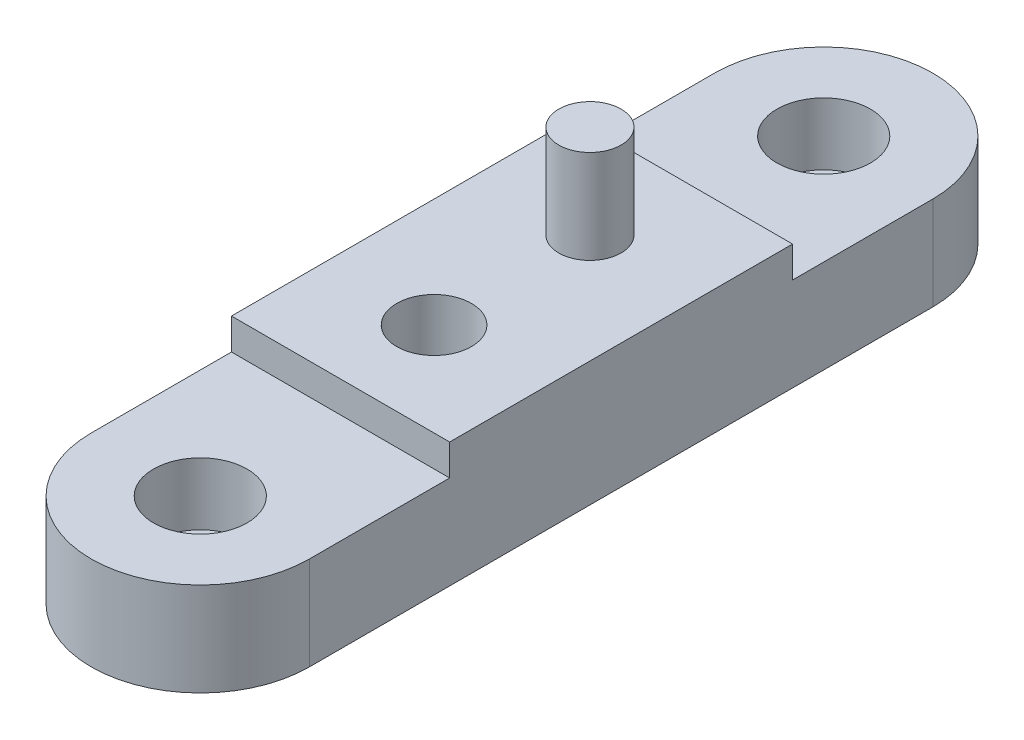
ISO-10303-21;
HEADER;
FILE_DESCRIPTION(('STEP AP214'),'2;1');
FILE_NAME('part.step','',(''),(''),'','','');
FILE_SCHEMA(('AUTOMOTIVE_DESIGN { 1 0 10303 214 1 1 1 1 }'));
ENDSEC;
DATA;
#1=APPLICATION_CONTEXT('core data for automotive mechanical design processes');
#2=APPLICATION_PROTOCOL_DEFINITION('international standard','automotive_design',2000,#1);
#3=PRODUCT_CONTEXT('',#1,'mechanical');
#4=PRODUCT('Part','Part','',(#3));
#5=PRODUCT_RELATED_PRODUCT_CATEGORY('part','',(#4));
#6=PRODUCT_DEFINITION_FORMATION('','',#4);
#7=PRODUCT_DEFINITION_CONTEXT('part definition',#1,'design');
#8=PRODUCT_DEFINITION('design','',#6,#7);
#9=PRODUCT_DEFINITION_SHAPE('','',#8);
#10=(LENGTH_UNIT() NAMED_UNIT(*) SI_UNIT(.MILLI.,.METRE.));
#11=(NAMED_UNIT(*) PLANE_ANGLE_UNIT() SI_UNIT($,.RADIAN.));
#12=(NAMED_UNIT(*) SI_UNIT($,.STERADIAN.) SOLID_ANGLE_UNIT());
#13=UNCERTAINTY_MEASURE_WITH_UNIT(LENGTH_MEASURE(1.E-05),#10,'distance_accuracy_value','');
#14=(GEOMETRIC_REPRESENTATION_CONTEXT(3) GLOBAL_UNCERTAINTY_ASSIGNED_CONTEXT((#13)) GLOBAL_UNIT_ASSIGNED_CONTEXT((#10,
#11,#12)) REPRESENTATION_CONTEXT('',''));
#15=CARTESIAN_POINT('',(0.,0.,0.));
#16=DIRECTION('',(0.,0.,1.));
#17=DIRECTION('',(1.,0.,0.));
#18=AXIS2_PLACEMENT_3D('',#15,#16,#17);
#19=CARTESIAN_POINT('',(0.,4.,0.));
#20=DIRECTION('',(0.,-1.,0.));
#21=DIRECTION('',(0.,0.,-1.));
#22=AXIS2_PLACEMENT_3D('',#19,#20,#21);
#23=CYLINDRICAL_SURFACE('',#22,3.5);
#24=CARTESIAN_POINT('',(0.,3.,0.));
#25=DIRECTION('',(0.,1.,0.));
#26=DIRECTION('',(0.,0.,1.));
#27=AXIS2_PLACEMENT_3D('',#24,#25,#26);
#28=CIRCLE('',#27,3.5);
#29=CARTESIAN_POINT('',(3.5,3.,0.));
#30=VERTEX_POINT('',#29);
#31=CARTESIAN_POINT('',(-3.5,3.,0.));
#32=VERTEX_POINT('',#31);
#33=EDGE_CURVE('E159',#30,#32,#28,.T.);
#34=ORIENTED_EDGE('',*,*,#33,.F.);
#35=DIRECTION('',(0.,-1.,0.));
#36=VECTOR('',#35,1.);
#37=CARTESIAN_POINT('',(3.5,4.,0.));
#38=LINE('',#37,#36);
#39=CARTESIAN_POINT('',(3.5,0.,0.));
#40=VERTEX_POINT('',#39);
#41=EDGE_CURVE('E44',#30,#40,#38,.T.);
#42=ORIENTED_EDGE('',*,*,#41,.T.);
#43=CARTESIAN_POINT('',(0.,0.,0.));
#44=DIRECTION('',(0.,1.,0.));
#45=DIRECTION('',(0.,0.,1.));
#46=AXIS2_PLACEMENT_3D('',#43,#44,#45);
#47=CIRCLE('',#46,3.5);
#48=CARTESIAN_POINT('',(-3.5,0.,0.));
#49=VERTEX_POINT('',#48);
#50=EDGE_CURVE('E165',#40,#49,#47,.T.);
#51=ORIENTED_EDGE('',*,*,#50,.T.);
#52=DIRECTION('',(0.,-1.,0.));
#53=VECTOR('',#52,1.);
#54=CARTESIAN_POINT('',(-3.5,4.,0.));
#55=LINE('',#54,#53);
#56=EDGE_CURVE('E11',#32,#49,#55,.T.);
#57=ORIENTED_EDGE('',*,*,#56,.F.);
#58=EDGE_LOOP('',(#34,#42,#51,#57));
#59=FACE_BOUND('',#58,.T.);
#60=ADVANCED_FACE('F37',(#59),#23,.T.);
#61=CARTESIAN_POINT('',(-3.5,4.,0.));
#62=DIRECTION('',(1.,0.,0.));
#63=DIRECTION('',(0.,0.,-1.));
#64=AXIS2_PLACEMENT_3D('',#61,#62,#63);
#65=PLANE('',#64);
#66=DIRECTION('',(0.,0.,1.));
#67=VECTOR('',#66,1.);
#68=CARTESIAN_POINT('',(-3.5,4.,0.));
#69=LINE('',#68,#67);
#70=CARTESIAN_POINT('',(-3.5,4.,4.5));
#71=VERTEX_POINT('',#70);
#72=CARTESIAN_POINT('',(-3.5,4.,15.5));
#73=VERTEX_POINT('',#72);
#74=EDGE_CURVE('E167',#71,#73,#69,.T.);
#75=ORIENTED_EDGE('',*,*,#74,.F.);
#76=DIRECTION('',(0.,1.,0.));
#77=VECTOR('',#76,1.);
#78=CARTESIAN_POINT('',(-3.5,3.,4.5));
#79=LINE('',#78,#77);
#80=CARTESIAN_POINT('',(-3.5,3.,4.5));
#81=VERTEX_POINT('',#80);
#82=EDGE_CURVE('E51',#81,#71,#79,.T.);
#83=ORIENTED_EDGE('',*,*,#82,.F.);
#84=DIRECTION('',(0.,0.,1.));
#85=VECTOR('',#84,1.);
#86=CARTESIAN_POINT('',(-3.5,3.,0.));
#87=LINE('',#86,#85);
#88=EDGE_CURVE('E151',#32,#81,#87,.T.);
#89=ORIENTED_EDGE('',*,*,#88,.F.);
#90=ORIENTED_EDGE('',*,*,#56,.T.);
#91=DIRECTION('',(0.,0.,1.));
#92=VECTOR('',#91,1.);
#93=CARTESIAN_POINT('',(-3.5,0.,0.));
#94=LINE('',#93,#92);
#95=CARTESIAN_POINT('',(-3.5,0.,20.));
#96=VERTEX_POINT('',#95);
#97=EDGE_CURVE('E174',#49,#96,#94,.T.);
#98=ORIENTED_EDGE('',*,*,#97,.T.);
#99=DIRECTION('',(0.,-1.,0.));
#100=VECTOR('',#99,1.);
#101=CARTESIAN_POINT('',(-3.5,4.,20.));
#102=LINE('',#101,#100);
#103=CARTESIAN_POINT('',(-3.5,3.,20.));
#104=VERTEX_POINT('',#103);
#105=EDGE_CURVE('E125',#104,#96,#102,.T.);
#106=ORIENTED_EDGE('',*,*,#105,.F.);
#107=DIRECTION('',(0.,0.,-1.));
#108=VECTOR('',#107,1.);
#109=CARTESIAN_POINT('',(-3.5,3.,20.));
#110=LINE('',#109,#108);
#111=CARTESIAN_POINT('',(-3.5,3.,15.5));
#112=VERTEX_POINT('',#111);
#113=EDGE_CURVE('E105',#104,#112,#110,.T.);
#114=ORIENTED_EDGE('',*,*,#113,.T.);
#115=DIRECTION('',(0.,1.,0.));
#116=VECTOR('',#115,1.);
#117=CARTESIAN_POINT('',(-3.5,3.,15.5));
#118=LINE('',#117,#116);
#119=EDGE_CURVE('E114',#112,#73,#118,.T.);
#120=ORIENTED_EDGE('',*,*,#119,.T.);
#121=EDGE_LOOP('',(#75,#83,#89,#90,#98,#106,#114,#120));
#122=FACE_BOUND('',#121,.T.);
#123=ADVANCED_FACE('F123',(#122),#65,.F.);
#124=CARTESIAN_POINT('',(3.5,4.,0.));
#125=DIRECTION('',(-1.,0.,0.));
#126=DIRECTION('',(0.,0.,1.));
#127=AXIS2_PLACEMENT_3D('',#124,#125,#126);
#128=PLANE('',#127);
#129=DIRECTION('',(0.,0.,-1.));
#130=VECTOR('',#129,1.);
#131=CARTESIAN_POINT('',(3.5,3.,0.));
#132=LINE('',#131,#130);
#133=CARTESIAN_POINT('',(3.5,3.,4.5));
#134=VERTEX_POINT('',#133);
#135=EDGE_CURVE('E157',#134,#30,#132,.T.);
#136=ORIENTED_EDGE('',*,*,#135,.F.);
#137=DIRECTION('',(0.,1.,0.));
#138=VECTOR('',#137,1.);
#139=CARTESIAN_POINT('',(3.5,3.,4.5));
#140=LINE('',#139,#138);
#141=CARTESIAN_POINT('',(3.5,4.,4.5));
#142=VERTEX_POINT('',#141);
#143=EDGE_CURVE('E162',#134,#142,#140,.T.);
#144=ORIENTED_EDGE('',*,*,#143,.T.);
#145=DIRECTION('',(0.,0.,-1.));
#146=VECTOR('',#145,1.);
#147=CARTESIAN_POINT('',(3.5,4.,0.));
#148=LINE('',#147,#146);
#149=CARTESIAN_POINT('',(3.5,4.,15.5));
#150=VERTEX_POINT('',#149);
#151=EDGE_CURVE('E169',#150,#142,#148,.T.);
#152=ORIENTED_EDGE('',*,*,#151,.F.);
#153=DIRECTION('',(0.,1.,0.));
#154=VECTOR('',#153,1.);
#155=CARTESIAN_POINT('',(3.5,3.,15.5));
#156=LINE('',#155,#154);
#157=CARTESIAN_POINT('',(3.5,3.,15.5));
#158=VERTEX_POINT('',#157);
#159=EDGE_CURVE('E120',#158,#150,#156,.T.);
#160=ORIENTED_EDGE('',*,*,#159,.F.);
#161=DIRECTION('',(0.,0.,1.));
#162=VECTOR('',#161,1.);
#163=CARTESIAN_POINT('',(3.5,3.,20.));
#164=LINE('',#163,#162);
#165=CARTESIAN_POINT('',(3.5,3.,20.));
#166=VERTEX_POINT('',#165);
#167=EDGE_CURVE('E107',#158,#166,#164,.T.);
#168=ORIENTED_EDGE('',*,*,#167,.T.);
#169=DIRECTION('',(0.,-1.,0.));
#170=VECTOR('',#169,1.);
#171=CARTESIAN_POINT('',(3.5,4.,20.));
#172=LINE('',#171,#170);
#173=CARTESIAN_POINT('',(3.5,0.,20.));
#174=VERTEX_POINT('',#173);
#175=EDGE_CURVE('E140',#166,#174,#172,.T.);
#176=ORIENTED_EDGE('',*,*,#175,.T.);
#177=DIRECTION('',(0.,0.,-1.));
#178=VECTOR('',#177,1.);
#179=CARTESIAN_POINT('',(3.5,0.,0.));
#180=LINE('',#179,#178);
#181=EDGE_CURVE('E170',#174,#40,#180,.T.);
#182=ORIENTED_EDGE('',*,*,#181,.T.);
#183=ORIENTED_EDGE('',*,*,#41,.F.);
#184=EDGE_LOOP('',(#136,#144,#152,#160,#168,#176,#182,#183));
#185=FACE_BOUND('',#184,.T.);
#186=ADVANCED_FACE('F179',(#185),#128,.F.);
#187=CARTESIAN_POINT('',(0.,4.,0.));
#188=DIRECTION('',(0.,1.,0.));
#189=DIRECTION('',(0.,0.,1.));
#190=AXIS2_PLACEMENT_3D('',#187,#188,#189);
#191=PLANE('',#190);
#192=CARTESIAN_POINT('',(0.,4.,12.5));
#193=DIRECTION('',(0.,1.,0.));
#194=DIRECTION('',(0.,0.,1.));
#195=AXIS2_PLACEMENT_3D('',#192,#193,#194);
#196=CIRCLE('',#195,1.2);
#197=CARTESIAN_POINT('',(0.,4.,13.7));
#198=VERTEX_POINT('',#197);
#199=EDGE_CURVE('E350',#198,#198,#196,.T.);
#200=ORIENTED_EDGE('',*,*,#199,.F.);
#201=EDGE_LOOP('',(#200));
#202=FACE_BOUND('',#201,.T.);
#203=CARTESIAN_POINT('',(0.,4.,7.5));
#204=DIRECTION('',(0.,1.,0.));
#205=DIRECTION('',(0.,0.,1.));
#206=AXIS2_PLACEMENT_3D('',#203,#204,#205);
#207=CIRCLE('',#206,1.);
#208=CARTESIAN_POINT('',(0.,4.,8.5));
#209=VERTEX_POINT('',#208);
#210=EDGE_CURVE('E352',#209,#209,#207,.T.);
#211=ORIENTED_EDGE('',*,*,#210,.F.);
#212=EDGE_LOOP('',(#211));
#213=FACE_BOUND('',#212,.T.);
#214=DIRECTION('',(1.,0.,0.));
#215=VECTOR('',#214,1.);
#216=CARTESIAN_POINT('',(-3.5,4.,4.5));
#217=LINE('',#216,#215);
#218=EDGE_CURVE('E148',#71,#142,#217,.T.);
#219=ORIENTED_EDGE('',*,*,#218,.F.);
#220=ORIENTED_EDGE('',*,*,#74,.T.);
#221=DIRECTION('',(1.,0.,0.));
#222=VECTOR('',#221,1.);
#223=CARTESIAN_POINT('',(-3.5,4.,15.5));
#224=LINE('',#223,#222);
#225=EDGE_CURVE('E117',#73,#150,#224,.T.);
#226=ORIENTED_EDGE('',*,*,#225,.T.);
#227=ORIENTED_EDGE('',*,*,#151,.T.);
#228=EDGE_LOOP('',(#219,#220,#226,#227));
#229=FACE_BOUND('',#228,.T.);
#230=ADVANCED_FACE('F190',(#202,#213,#229),#191,.T.);
#231=CARTESIAN_POINT('',(0.,0.,0.));
#232=DIRECTION('',(0.,1.,0.));
#233=DIRECTION('',(0.,0.,1.));
#234=AXIS2_PLACEMENT_3D('',#231,#232,#233);
#235=PLANE('',#234);
#236=CARTESIAN_POINT('',(0.,0.,12.5));
#237=DIRECTION('',(0.,1.,0.));
#238=DIRECTION('',(0.,0.,1.));
#239=AXIS2_PLACEMENT_3D('',#236,#237,#238);
#240=CIRCLE('',#239,1.2);
#241=CARTESIAN_POINT('',(0.,0.,13.7));
#242=VERTEX_POINT('',#241);
#243=EDGE_CURVE('E347',#242,#242,#240,.T.);
#244=ORIENTED_EDGE('',*,*,#243,.T.);
#245=EDGE_LOOP('',(#244));
#246=FACE_BOUND('',#245,.T.);
#247=ORIENTED_EDGE('',*,*,#50,.F.);
#248=ORIENTED_EDGE('',*,*,#181,.F.);
#249=CARTESIAN_POINT('',(0.,0.,20.));
#250=DIRECTION('',(0.,-1.,0.));
#251=DIRECTION('',(0.,0.,-1.));
#252=AXIS2_PLACEMENT_3D('',#249,#250,#251);
#253=CIRCLE('',#252,3.5);
#254=EDGE_CURVE('E136',#174,#96,#253,.T.);
#255=ORIENTED_EDGE('',*,*,#254,.T.);
#256=ORIENTED_EDGE('',*,*,#97,.F.);
#257=EDGE_LOOP('',(#247,#248,#255,#256));
#258=FACE_BOUND('',#257,.T.);
#259=ADVANCED_FACE('F184',(#246,#258),#235,.F.);
#260=CARTESIAN_POINT('',(-3.5,3.,4.5));
#261=DIRECTION('',(0.,0.,1.));
#262=DIRECTION('',(1.,0.,0.));
#263=AXIS2_PLACEMENT_3D('',#260,#261,#262);
#264=PLANE('',#263);
#265=ORIENTED_EDGE('',*,*,#218,.T.);
#266=ORIENTED_EDGE('',*,*,#143,.F.);
#267=DIRECTION('',(1.,0.,0.));
#268=VECTOR('',#267,1.);
#269=CARTESIAN_POINT('',(-3.5,3.,4.5));
#270=LINE('',#269,#268);
#271=EDGE_CURVE('E154',#81,#134,#270,.T.);
#272=ORIENTED_EDGE('',*,*,#271,.F.);
#273=ORIENTED_EDGE('',*,*,#82,.T.);
#274=EDGE_LOOP('',(#265,#266,#272,#273));
#275=FACE_BOUND('',#274,.T.);
#276=ADVANCED_FACE('F215',(#275),#264,.F.);
#277=CARTESIAN_POINT('',(0.,3.,0.));
#278=DIRECTION('',(0.,1.,0.));
#279=DIRECTION('',(0.,0.,1.));
#280=AXIS2_PLACEMENT_3D('',#277,#278,#279);
#281=PLANE('',#280);
#282=CARTESIAN_POINT('',(0.,3.,0.));
#283=DIRECTION('',(0.,1.,0.));
#284=DIRECTION('',(0.,0.,1.));
#285=AXIS2_PLACEMENT_3D('',#282,#283,#284);
#286=CIRCLE('',#285,1.5);
#287=CARTESIAN_POINT('',(0.,3.,1.5));
#288=VERTEX_POINT('',#287);
#289=EDGE_CURVE('E144',#288,#288,#286,.T.);
#290=ORIENTED_EDGE('',*,*,#289,.F.);
#291=EDGE_LOOP('',(#290));
#292=FACE_BOUND('',#291,.T.);
#293=ORIENTED_EDGE('',*,*,#88,.T.);
#294=ORIENTED_EDGE('',*,*,#271,.T.);
#295=ORIENTED_EDGE('',*,*,#135,.T.);
#296=ORIENTED_EDGE('',*,*,#33,.T.);
#297=EDGE_LOOP('',(#293,#294,#295,#296));
#298=FACE_BOUND('',#297,.T.);
#299=ADVANCED_FACE('F188',(#292,#298),#281,.T.);
#300=CARTESIAN_POINT('',(0.,1.,0.));
#301=DIRECTION('',(0.,1.,0.));
#302=DIRECTION('',(0.,0.,1.));
#303=AXIS2_PLACEMENT_3D('',#300,#301,#302);
#304=CYLINDRICAL_SURFACE('',#303,1.5);
#305=CARTESIAN_POINT('',(0.,1.,0.));
#306=DIRECTION('',(0.,1.,0.));
#307=DIRECTION('',(0.,0.,1.));
#308=AXIS2_PLACEMENT_3D('',#305,#306,#307);
#309=CIRCLE('',#308,1.5);
#310=CARTESIAN_POINT('',(0.,1.,1.5));
#311=VERTEX_POINT('',#310);
#312=EDGE_CURVE('E145',#311,#311,#309,.T.);
#313=ORIENTED_EDGE('',*,*,#312,.F.);
#314=EDGE_LOOP('',(#313));
#315=FACE_BOUND('',#314,.T.);
#316=ORIENTED_EDGE('',*,*,#289,.T.);
#317=EDGE_LOOP('',(#316));
#318=FACE_BOUND('',#317,.T.);
#319=ADVANCED_FACE('F201',(#315,#318),#304,.F.);
#320=CARTESIAN_POINT('',(0.,1.,0.));
#321=DIRECTION('',(0.,1.,0.));
#322=DIRECTION('',(0.,0.,1.));
#323=AXIS2_PLACEMENT_3D('',#320,#321,#322);
#324=PLANE('',#323);
#325=ORIENTED_EDGE('',*,*,#312,.T.);
#326=EDGE_LOOP('',(#325));
#327=FACE_BOUND('',#326,.T.);
#328=ADVANCED_FACE('F194',(#327),#324,.T.);
#329=CARTESIAN_POINT('',(0.,4.,20.));
#330=DIRECTION('',(0.,-1.,0.));
#331=DIRECTION('',(0.,0.,1.));
#332=AXIS2_PLACEMENT_3D('',#329,#330,#331);
#333=CYLINDRICAL_SURFACE('',#332,3.5);
#334=CARTESIAN_POINT('',(0.,3.,20.));
#335=DIRECTION('',(0.,-1.,0.));
#336=DIRECTION('',(0.,0.,-1.));
#337=AXIS2_PLACEMENT_3D('',#334,#335,#336);
#338=CIRCLE('',#337,3.5);
#339=EDGE_CURVE('E121',#166,#104,#338,.T.);
#340=ORIENTED_EDGE('',*,*,#339,.T.);
#341=ORIENTED_EDGE('',*,*,#105,.T.);
#342=ORIENTED_EDGE('',*,*,#254,.F.);
#343=ORIENTED_EDGE('',*,*,#175,.F.);
#344=EDGE_LOOP('',(#340,#341,#342,#343));
#345=FACE_BOUND('',#344,.T.);
#346=ADVANCED_FACE('F192',(#345),#333,.T.);
#347=CARTESIAN_POINT('',(-3.5,3.,15.5));
#348=DIRECTION('',(0.,0.,-1.));
#349=DIRECTION('',(1.,0.,0.));
#350=AXIS2_PLACEMENT_3D('',#347,#348,#349);
#351=PLANE('',#350);
#352=ORIENTED_EDGE('',*,*,#225,.F.);
#353=ORIENTED_EDGE('',*,*,#119,.F.);
#354=DIRECTION('',(1.,0.,0.));
#355=VECTOR('',#354,1.);
#356=CARTESIAN_POINT('',(-3.5,3.,15.5));
#357=LINE('',#356,#355);
#358=EDGE_CURVE('E100',#112,#158,#357,.T.);
#359=ORIENTED_EDGE('',*,*,#358,.T.);
#360=ORIENTED_EDGE('',*,*,#159,.T.);
#361=EDGE_LOOP('',(#352,#353,#359,#360));
#362=FACE_BOUND('',#361,.T.);
#363=ADVANCED_FACE('F115',(#362),#351,.F.);
#364=CARTESIAN_POINT('',(0.,3.,20.));
#365=DIRECTION('',(0.,1.,0.));
#366=DIRECTION('',(0.,0.,-1.));
#367=AXIS2_PLACEMENT_3D('',#364,#365,#366);
#368=PLANE('',#367);
#369=CARTESIAN_POINT('',(0.,3.,20.));
#370=DIRECTION('',(0.,-1.,0.));
#371=DIRECTION('',(0.,0.,-1.));
#372=AXIS2_PLACEMENT_3D('',#369,#370,#371);
#373=CIRCLE('',#372,1.5);
#374=CARTESIAN_POINT('',(0.,3.,18.5));
#375=VERTEX_POINT('',#374);
#376=EDGE_CURVE('E131',#375,#375,#373,.T.);
#377=ORIENTED_EDGE('',*,*,#376,.T.);
#378=EDGE_LOOP('',(#377));
#379=FACE_BOUND('',#378,.T.);
#380=ORIENTED_EDGE('',*,*,#113,.F.);
#381=ORIENTED_EDGE('',*,*,#339,.F.);
#382=ORIENTED_EDGE('',*,*,#167,.F.);
#383=ORIENTED_EDGE('',*,*,#358,.F.);
#384=EDGE_LOOP('',(#380,#381,#382,#383));
#385=FACE_BOUND('',#384,.T.);
#386=ADVANCED_FACE('F102',(#379,#385),#368,.T.);
#387=CARTESIAN_POINT('',(0.,1.,20.));
#388=DIRECTION('',(0.,1.,0.));
#389=DIRECTION('',(0.,0.,-1.));
#390=AXIS2_PLACEMENT_3D('',#387,#388,#389);
#391=CYLINDRICAL_SURFACE('',#390,1.5);
#392=CARTESIAN_POINT('',(0.,1.,20.));
#393=DIRECTION('',(0.,-1.,0.));
#394=DIRECTION('',(0.,0.,-1.));
#395=AXIS2_PLACEMENT_3D('',#392,#393,#394);
#396=CIRCLE('',#395,1.5);
#397=CARTESIAN_POINT('',(0.,1.,18.5));
#398=VERTEX_POINT('',#397);
#399=EDGE_CURVE('E128',#398,#398,#396,.T.);
#400=ORIENTED_EDGE('',*,*,#399,.T.);
#401=EDGE_LOOP('',(#400));
#402=FACE_BOUND('',#401,.T.);
#403=ORIENTED_EDGE('',*,*,#376,.F.);
#404=EDGE_LOOP('',(#403));
#405=FACE_BOUND('',#404,.T.);
#406=ADVANCED_FACE('F292',(#402,#405),#391,.F.);
#407=CARTESIAN_POINT('',(0.,1.,20.));
#408=DIRECTION('',(0.,1.,0.));
#409=DIRECTION('',(0.,0.,-1.));
#410=AXIS2_PLACEMENT_3D('',#407,#408,#409);
#411=PLANE('',#410);
#412=ORIENTED_EDGE('',*,*,#399,.F.);
#413=EDGE_LOOP('',(#412));
#414=FACE_BOUND('',#413,.T.);
#415=ADVANCED_FACE('F301',(#414),#411,.T.);
#416=CARTESIAN_POINT('',(0.,7.,7.5));
#417=DIRECTION('',(0.,-1.,0.));
#418=DIRECTION('',(0.,0.,-1.));
#419=AXIS2_PLACEMENT_3D('',#416,#417,#418);
#420=CYLINDRICAL_SURFACE('',#419,1.);
#421=CARTESIAN_POINT('',(0.,7.,7.5));
#422=DIRECTION('',(0.,1.,0.));
#423=DIRECTION('',(0.,0.,1.));
#424=AXIS2_PLACEMENT_3D('',#421,#422,#423);
#425=CIRCLE('',#424,1.);
#426=CARTESIAN_POINT('',(0.,7.,8.5));
#427=VERTEX_POINT('',#426);
#428=EDGE_CURVE('E355',#427,#427,#425,.T.);
#429=ORIENTED_EDGE('',*,*,#428,.F.);
#430=EDGE_LOOP('',(#429));
#431=FACE_BOUND('',#430,.T.);
#432=ORIENTED_EDGE('',*,*,#210,.T.);
#433=EDGE_LOOP('',(#432));
#434=FACE_BOUND('',#433,.T.);
#435=ADVANCED_FACE('F310',(#431,#434),#420,.T.);
#436=CARTESIAN_POINT('',(0.,7.,7.5));
#437=DIRECTION('',(0.,1.,0.));
#438=DIRECTION('',(0.,0.,1.));
#439=AXIS2_PLACEMENT_3D('',#436,#437,#438);
#440=PLANE('',#439);
#441=ORIENTED_EDGE('',*,*,#428,.T.);
#442=EDGE_LOOP('',(#441));
#443=FACE_BOUND('',#442,.T.);
#444=ADVANCED_FACE('F319',(#443),#440,.T.);
#445=CARTESIAN_POINT('',(0.,0.,12.5));
#446=DIRECTION('',(0.,1.,0.));
#447=DIRECTION('',(0.,0.,1.));
#448=AXIS2_PLACEMENT_3D('',#445,#446,#447);
#449=CYLINDRICAL_SURFACE('',#448,1.2);
#450=ORIENTED_EDGE('',*,*,#243,.F.);
#451=EDGE_LOOP('',(#450));
#452=FACE_BOUND('',#451,.T.);
#453=ORIENTED_EDGE('',*,*,#199,.T.);
#454=EDGE_LOOP('',(#453));
#455=FACE_BOUND('',#454,.T.);
#456=ADVANCED_FACE('F327',(#452,#455),#449,.F.);
#457=CLOSED_SHELL('',(#60,#123,#186,#230,#259,#276,#299,#319,#328,#346,#363,#386,#406,#415,#435,
#444,#456));
#458=MANIFOLD_SOLID_BREP('B2',#457);
#459=ADVANCED_BREP_SHAPE_REPRESENTATION('',(#18,#458),#14);
#460=SHAPE_DEFINITION_REPRESENTATION(#9,#459);
ENDSEC;
END-ISO-10303-21;
